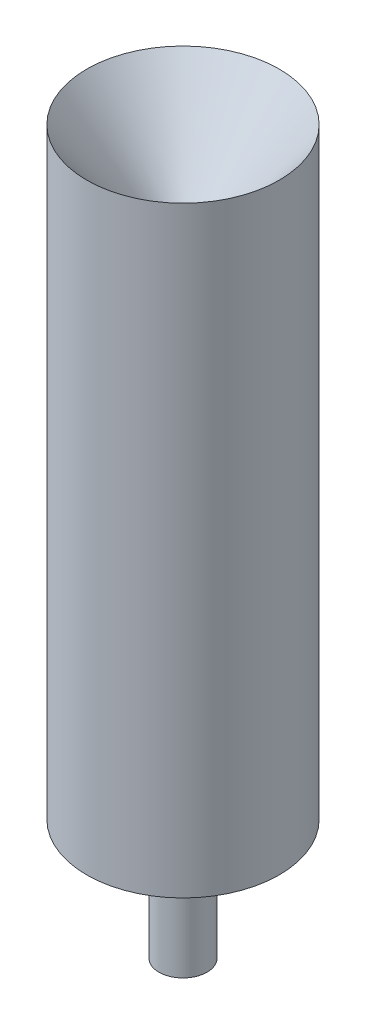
from build123d import *


with BuildPart() as part:
    # Sketch1 → Revolve1 (revolve)
    with BuildSketch(Plane.XY, mode=Mode.PRIVATE) as revolve1_sk:
        Polygon((0, 0), (2, 0), (2, 10), (8, 10), (8, 60), (0, 50), align=None)
    revolve(revolve1_sk.sketch.rotate(Axis((0, 50, 0), (0, -1, 0)), 180), axis=Axis((0, 50, 0), (0, -1, 0)))


solid = part.part
